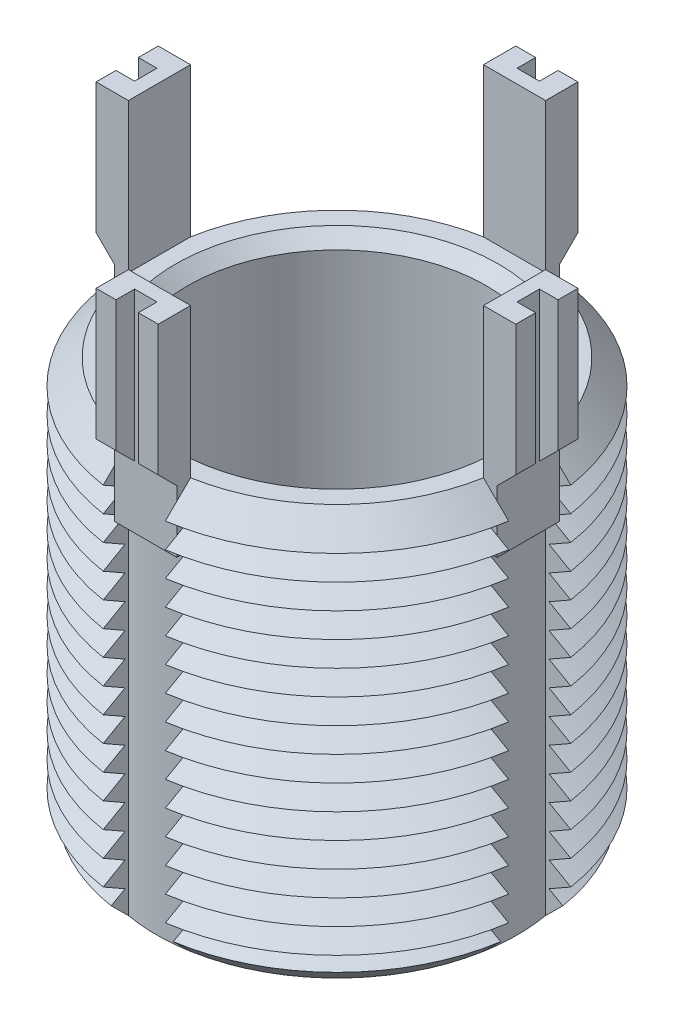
from build123d import *

# Parameters (mm, degrees)
SKETCH1_R               = 16.5
BOSS_EXTRUDE1_DEPTH     = 33
CHAMFER1_SIZE           = 2
LPATTERN1_COUNT         = 15
LPATTERN1_PITCH         = 2
CUT_EXTRUDE1_REACH      = 42.417
CIRPATTERN1_COUNT       = 4
BOSS_EXTRUDE3_DEPTH     = 2.5
CIRPATTERN2_COUNT       = 4
CUT_EXTRUDE3_DEPTH      = 51.941748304
CUT_EXTRUDE3_DEPTH_BACK = 51.941748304
SKETCH6_W               = 1.5
SKETCH6_H               = 1.8
SKETCH6_W_2             = 1.8
SKETCH6_H_2             = 1.5
SKETCH7_R               = 12
CUT_EXTRUDE4_DEPTH      = 33
CHAMFER2_SIZE           = 1


with BuildPart() as part:
    # Sketch1 → Boss-Extrude1 (new body)
    with BuildSketch(Plane(origin=(0, 0, 0), x_dir=(1, 0, 0), z_dir=(0, 1, 0))):
        with Locations(Location((0, 0, 0), (0, 0, 270))):
            Circle(SKETCH1_R)
    extrude(amount=-BOSS_EXTRUDE1_DEPTH)

    # Chamfer1
    chamfer1_edges = [part.edges().sort_by_distance(p)[0] for p in [
        (0, 0, -16.5),
        (0, -33, -16.5),
    ]]
    chamfer(chamfer1_edges, length=CHAMFER1_SIZE)

    # Sketch3 → Cut-Revolve1 (revolve, cut)
    with BuildSketch(Plane(origin=(0, 0, 0), x_dir=(0, 0, -1), z_dir=(1, 0, 0))):
        Polygon((-16.5, -2), (-14.767949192, -3), (-16.5, -4), align=None)
    cut_revolve1 = revolve(axis=Axis((0, 0.885892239, 0), (0, -1, 0)), mode=Mode.SUBTRACT)

    # LPattern1: Cut-Revolve1 ×15
    with Locations(*[(0, -i * LPATTERN1_PITCH, 0) for i in range(1, LPATTERN1_COUNT)]):
        add(cut_revolve1, mode=Mode.SUBTRACT)

    # Cut-Extrude1: up to this cone (the profile starts inside it)
    cut_extrude1_end = Plane(origin=(0, 0, 0), z_dir=(0, 1, 0)).offset(-47.499999) * Cone(1e-06, 137.917, 137.916999, align=(Align.CENTER, Align.CENTER, Align.MIN), mode=Mode.PRIVATE)
    # Sketch4 → Cut-Extrude1 (cut, up to the surface)
    with BuildSketch(Plane(origin=(0, 0, 0), x_dir=(1, 0, 0), z_dir=(0, 1, 0)), mode=Mode.PRIVATE) as cut_extrude1_sk1:
        with BuildLine():
            Line((-14.282856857, 2.5), (-16.30950643, 2.5))
            ThreePointArc((-16.30950643, 2.5), (-16.5, 0), (-16.30950643, -2.5))
            Line((-16.30950643, -2.5), (-14.282856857, -2.5))
            ThreePointArc((-14.282856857, -2.5), (-14.5, 0), (-14.282856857, 2.5))
        make_face()
    cut_extrude1_tool1 = extrude(cut_extrude1_sk1.sketch, amount=-CUT_EXTRUDE1_REACH, mode=Mode.PRIVATE) & cut_extrude1_end
    cut_extrude1 = cut_extrude1_tool1.solids().sort_by_distance((-15.432004, 0, 0))[0]
    add(cut_extrude1, mode=Mode.SUBTRACT)

    # CirPattern1: Cut-Extrude1 ×4 about axis
    cirpattern1_axis = Axis((0, 0, 0), (0, 1, 0))
    for i in range(1, CIRPATTERN1_COUNT):
        add(cut_extrude1.rotate(cirpattern1_axis, i * 360 / CIRPATTERN1_COUNT), mode=Mode.SUBTRACT)

    # Sketch5 → Boss-Extrude3 (add, symmetric)
    with BuildSketch(Plane(origin=(0, 0, 0), x_dir=(0, 0, -1), z_dir=(1, 0, 0))):
        Polygon((-14.282856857, 12), (-14.282856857, -5), (-15.382856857, -5), (-15.382856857, 0), (-16.882856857, 1.5), (-16.882856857, 12), align=None)
    boss_extrude3 = extrude(amount=BOSS_EXTRUDE3_DEPTH, both=True)

    # CirPattern2: Boss-Extrude3 ×4 about axis
    cirpattern2_axis = Axis((0, 0, 0), (0, 1, 0))
    for i in range(1, CIRPATTERN2_COUNT):
        add(boss_extrude3.rotate(cirpattern2_axis, i * 360 / CIRPATTERN2_COUNT))

    # Sketch6 → Cut-Extrude3 (cut, two sides: drawn at the far end of the back side and taken through both)
    with BuildSketch(Plane(origin=(0, 12, 0), x_dir=(1, 0, 0), z_dir=(0, 1, 0)).offset(-CUT_EXTRUDE3_DEPTH_BACK)):
        with Locations((-16.132856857, 0)):
            Rectangle(SKETCH6_W, SKETCH6_H)
        with Locations((0, 16.132856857)):
            Rectangle(SKETCH6_W_2, SKETCH6_H_2)
        with Locations((16.132856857, 0)):
            Rectangle(SKETCH6_W, SKETCH6_H)
        with Locations((0, -16.132856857)):
            Rectangle(SKETCH6_W_2, SKETCH6_H_2)
    extrude(amount=CUT_EXTRUDE3_DEPTH + CUT_EXTRUDE3_DEPTH_BACK, mode=Mode.SUBTRACT)

    # Sketch7 → Cut-Extrude4 (cut)
    with BuildSketch(Plane(origin=(0, 0, 0), x_dir=(1, 0, 0), z_dir=(0, 1, 0))):
        with Locations(Location((0, 0, 0), (0, 0, 270))):
            Circle(SKETCH7_R)
    extrude(amount=-CUT_EXTRUDE4_DEPTH, mode=Mode.SUBTRACT)

    # Chamfer2
    chamfer2_edges = [part.edges().sort_by_distance(p)[0] for p in [
        (0, 0, -12),
        (0, -33, -12),
    ]]
    chamfer(chamfer2_edges, length=CHAMFER2_SIZE)


solid = part.part
